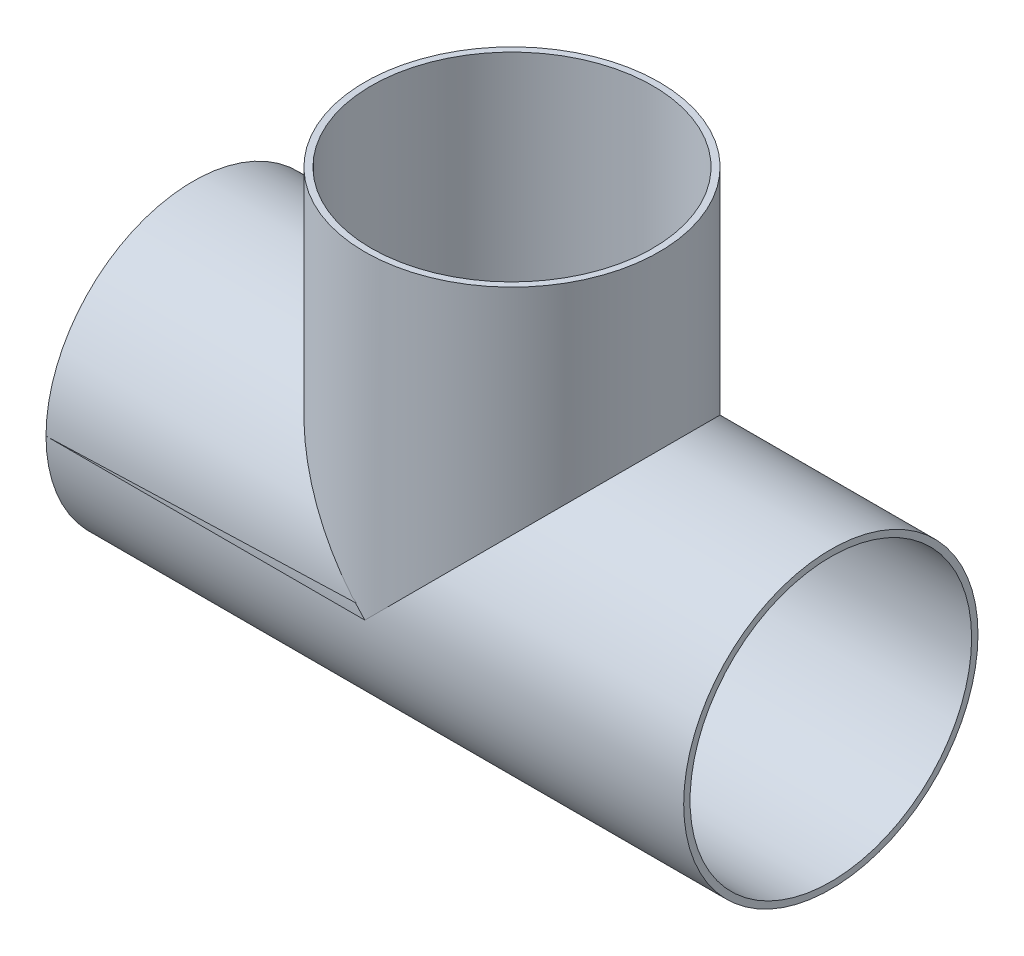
ISO-10303-21;
HEADER;
FILE_DESCRIPTION(('STEP AP214'),'2;1');
FILE_NAME('part.step','',(''),(''),'','','');
FILE_SCHEMA(('AUTOMOTIVE_DESIGN { 1 0 10303 214 1 1 1 1 }'));
ENDSEC;
DATA;
#1=APPLICATION_CONTEXT('core data for automotive mechanical design processes');
#2=APPLICATION_PROTOCOL_DEFINITION('international standard','automotive_design',2000,#1);
#3=PRODUCT_CONTEXT('',#1,'mechanical');
#4=PRODUCT('Part','Part','',(#3));
#5=PRODUCT_RELATED_PRODUCT_CATEGORY('part','',(#4));
#6=PRODUCT_DEFINITION_FORMATION('','',#4);
#7=PRODUCT_DEFINITION_CONTEXT('part definition',#1,'design');
#8=PRODUCT_DEFINITION('design','',#6,#7);
#9=PRODUCT_DEFINITION_SHAPE('','',#8);
#10=(LENGTH_UNIT() NAMED_UNIT(*) SI_UNIT(.MILLI.,.METRE.));
#11=(NAMED_UNIT(*) PLANE_ANGLE_UNIT() SI_UNIT($,.RADIAN.));
#12=(NAMED_UNIT(*) SI_UNIT($,.STERADIAN.) SOLID_ANGLE_UNIT());
#13=UNCERTAINTY_MEASURE_WITH_UNIT(LENGTH_MEASURE(1.E-05),#10,'distance_accuracy_value','');
#14=(GEOMETRIC_REPRESENTATION_CONTEXT(3) GLOBAL_UNCERTAINTY_ASSIGNED_CONTEXT((#13)) GLOBAL_UNIT_ASSIGNED_CONTEXT((#10,
#11,#12)) REPRESENTATION_CONTEXT('',''));
#15=CARTESIAN_POINT('',(0.,0.,0.));
#16=DIRECTION('',(0.,0.,1.));
#17=DIRECTION('',(1.,0.,0.));
#18=AXIS2_PLACEMENT_3D('',#15,#16,#17);
#19=CARTESIAN_POINT('',(0.,82.55,0.));
#20=DIRECTION('',(0.,-1.,0.));
#21=DIRECTION('',(0.,0.,-1.));
#22=AXIS2_PLACEMENT_3D('',#19,#20,#21);
#23=CYLINDRICAL_SURFACE('',#22,38.1);
#24=CARTESIAN_POINT('',(0.,82.55,0.));
#25=DIRECTION('',(0.,1.,0.));
#26=DIRECTION('',(0.,0.,1.));
#27=AXIS2_PLACEMENT_3D('',#24,#25,#26);
#28=CIRCLE('',#27,38.1);
#29=CARTESIAN_POINT('',(0.,82.55,38.1));
#30=VERTEX_POINT('',#29);
#31=EDGE_CURVE('E11',#30,#30,#28,.T.);
#32=ORIENTED_EDGE('',*,*,#31,.F.);
#33=EDGE_LOOP('',(#32));
#34=FACE_BOUND('',#33,.T.);
#35=CARTESIAN_POINT('',(0.,0.,0.));
#36=DIRECTION('',(-0.707106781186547,-0.707106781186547,0.));
#37=DIRECTION('',(0.707106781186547,-0.707106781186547,0.));
#38=AXIS2_PLACEMENT_3D('',#35,#36,#37);
#39=ELLIPSE('',#38,53.8815367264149,38.1);
#40=CARTESIAN_POINT('',(0.,0.,38.1));
#41=VERTEX_POINT('',#40);
#42=CARTESIAN_POINT('',(0.,0.,-38.1));
#43=VERTEX_POINT('',#42);
#44=EDGE_CURVE('E40',#41,#43,#39,.T.);
#45=ORIENTED_EDGE('',*,*,#44,.F.);
#46=CARTESIAN_POINT('',(0.,0.,0.));
#47=DIRECTION('',(0.707106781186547,-0.707106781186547,0.));
#48=DIRECTION('',(-0.707106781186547,-0.707106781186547,0.));
#49=AXIS2_PLACEMENT_3D('',#46,#47,#48);
#50=ELLIPSE('',#49,53.8815367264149,38.1);
#51=EDGE_CURVE('E53',#43,#41,#50,.T.);
#52=ORIENTED_EDGE('',*,*,#51,.F.);
#53=EDGE_LOOP('',(#45,#52));
#54=FACE_BOUND('',#53,.T.);
#55=ADVANCED_FACE('F33',(#34,#54),#23,.T.);
#56=CARTESIAN_POINT('',(0.,82.55,0.));
#57=DIRECTION('',(0.,1.,0.));
#58=DIRECTION('',(0.,0.,1.));
#59=AXIS2_PLACEMENT_3D('',#56,#57,#58);
#60=PLANE('',#59);
#61=CARTESIAN_POINT('',(0.,82.55,0.));
#62=DIRECTION('',(0.,1.,0.));
#63=DIRECTION('',(0.,0.,1.));
#64=AXIS2_PLACEMENT_3D('',#61,#62,#63);
#65=CIRCLE('',#64,36.449);
#66=CARTESIAN_POINT('',(0.,82.55,36.449));
#67=VERTEX_POINT('',#66);
#68=EDGE_CURVE('E65',#67,#67,#65,.T.);
#69=ORIENTED_EDGE('',*,*,#68,.F.);
#70=EDGE_LOOP('',(#69));
#71=FACE_BOUND('',#70,.T.);
#72=ORIENTED_EDGE('',*,*,#31,.T.);
#73=EDGE_LOOP('',(#72));
#74=FACE_BOUND('',#73,.T.);
#75=ADVANCED_FACE('F80',(#71,#74),#60,.T.);
#76=CARTESIAN_POINT('',(82.55,0.,0.));
#77=DIRECTION('',(-1.,0.,0.));
#78=DIRECTION('',(0.,0.,1.));
#79=AXIS2_PLACEMENT_3D('',#76,#77,#78);
#80=CYLINDRICAL_SURFACE('',#79,38.1);
#81=CARTESIAN_POINT('',(-82.55,0.,0.));
#82=DIRECTION('',(1.,0.,0.));
#83=DIRECTION('',(0.,0.,-1.));
#84=AXIS2_PLACEMENT_3D('',#81,#82,#83);
#85=CIRCLE('',#84,38.1);
#86=CARTESIAN_POINT('',(-82.55,0.,-38.1));
#87=VERTEX_POINT('',#86);
#88=EDGE_CURVE('E68',#87,#87,#85,.T.);
#89=ORIENTED_EDGE('',*,*,#88,.T.);
#90=EDGE_LOOP('',(#89));
#91=FACE_BOUND('',#90,.T.);
#92=CARTESIAN_POINT('',(82.55,0.,0.));
#93=DIRECTION('',(1.,0.,0.));
#94=DIRECTION('',(0.,0.,-1.));
#95=AXIS2_PLACEMENT_3D('',#92,#93,#94);
#96=CIRCLE('',#95,38.1);
#97=CARTESIAN_POINT('',(82.55,0.,-38.1));
#98=VERTEX_POINT('',#97);
#99=EDGE_CURVE('E72',#98,#98,#96,.T.);
#100=ORIENTED_EDGE('',*,*,#99,.F.);
#101=EDGE_LOOP('',(#100));
#102=FACE_BOUND('',#101,.T.);
#103=ORIENTED_EDGE('',*,*,#51,.T.);
#104=ORIENTED_EDGE('',*,*,#44,.T.);
#105=EDGE_LOOP('',(#103,#104));
#106=FACE_BOUND('',#105,.T.);
#107=ADVANCED_FACE('F78',(#91,#102,#106),#80,.T.);
#108=CARTESIAN_POINT('',(82.55,0.,0.));
#109=DIRECTION('',(1.,0.,0.));
#110=DIRECTION('',(0.,0.,-1.));
#111=AXIS2_PLACEMENT_3D('',#108,#109,#110);
#112=PLANE('',#111);
#113=CARTESIAN_POINT('',(82.55,0.,0.));
#114=DIRECTION('',(1.,0.,0.));
#115=DIRECTION('',(0.,0.,-1.));
#116=AXIS2_PLACEMENT_3D('',#113,#114,#115);
#117=CIRCLE('',#116,36.449);
#118=CARTESIAN_POINT('',(82.55,0.,-36.449));
#119=VERTEX_POINT('',#118);
#120=EDGE_CURVE('E112',#119,#119,#117,.T.);
#121=ORIENTED_EDGE('',*,*,#120,.F.);
#122=EDGE_LOOP('',(#121));
#123=FACE_BOUND('',#122,.T.);
#124=ORIENTED_EDGE('',*,*,#99,.T.);
#125=EDGE_LOOP('',(#124));
#126=FACE_BOUND('',#125,.T.);
#127=ADVANCED_FACE('F91',(#123,#126),#112,.T.);
#128=CARTESIAN_POINT('',(-82.55,0.,0.));
#129=DIRECTION('',(1.,0.,0.));
#130=DIRECTION('',(0.,0.,-1.));
#131=AXIS2_PLACEMENT_3D('',#128,#129,#130);
#132=PLANE('',#131);
#133=CARTESIAN_POINT('',(-82.55,0.,0.));
#134=DIRECTION('',(1.,0.,0.));
#135=DIRECTION('',(0.,0.,-1.));
#136=AXIS2_PLACEMENT_3D('',#133,#134,#135);
#137=CIRCLE('',#136,36.449);
#138=CARTESIAN_POINT('',(-82.55,0.,-36.449));
#139=VERTEX_POINT('',#138);
#140=EDGE_CURVE('E61',#139,#139,#137,.T.);
#141=ORIENTED_EDGE('',*,*,#140,.T.);
#142=EDGE_LOOP('',(#141));
#143=FACE_BOUND('',#142,.T.);
#144=ORIENTED_EDGE('',*,*,#88,.F.);
#145=EDGE_LOOP('',(#144));
#146=FACE_BOUND('',#145,.T.);
#147=ADVANCED_FACE('F96',(#143,#146),#132,.F.);
#148=CARTESIAN_POINT('',(0.,0.,0.));
#149=DIRECTION('',(0.,1.,0.));
#150=DIRECTION('',(0.,0.,1.));
#151=AXIS2_PLACEMENT_3D('',#148,#149,#150);
#152=CYLINDRICAL_SURFACE('',#151,36.449);
#153=CARTESIAN_POINT('',(0.,0.,0.));
#154=DIRECTION('',(-0.707106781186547,0.707106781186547,0.));
#155=DIRECTION('',(0.707106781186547,0.707106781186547,0.));
#156=AXIS2_PLACEMENT_3D('',#153,#154,#155);
#157=ELLIPSE('',#156,51.5466701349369,36.449);
#158=CARTESIAN_POINT('',(0.,0.,-36.449));
#159=VERTEX_POINT('',#158);
#160=CARTESIAN_POINT('',(0.,0.,36.449));
#161=VERTEX_POINT('',#160);
#162=EDGE_CURVE('E58',#159,#161,#157,.F.);
#163=ORIENTED_EDGE('',*,*,#162,.T.);
#164=CARTESIAN_POINT('',(0.,0.,0.));
#165=DIRECTION('',(0.707106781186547,0.707106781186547,0.));
#166=DIRECTION('',(-0.707106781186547,0.707106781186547,0.));
#167=AXIS2_PLACEMENT_3D('',#164,#165,#166);
#168=ELLIPSE('',#167,51.5466701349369,36.449);
#169=EDGE_CURVE('E46',#161,#159,#168,.F.);
#170=ORIENTED_EDGE('',*,*,#169,.T.);
#171=EDGE_LOOP('',(#163,#170));
#172=FACE_BOUND('',#171,.T.);
#173=ORIENTED_EDGE('',*,*,#68,.T.);
#174=EDGE_LOOP('',(#173));
#175=FACE_BOUND('',#174,.T.);
#176=ADVANCED_FACE('F63',(#172,#175),#152,.F.);
#177=CARTESIAN_POINT('',(-82.55,0.,0.));
#178=DIRECTION('',(1.,0.,0.));
#179=DIRECTION('',(0.,0.,-1.));
#180=AXIS2_PLACEMENT_3D('',#177,#178,#179);
#181=CYLINDRICAL_SURFACE('',#180,36.449);
#182=ORIENTED_EDGE('',*,*,#120,.T.);
#183=EDGE_LOOP('',(#182));
#184=FACE_BOUND('',#183,.T.);
#185=ORIENTED_EDGE('',*,*,#140,.F.);
#186=EDGE_LOOP('',(#185));
#187=FACE_BOUND('',#186,.T.);
#188=ORIENTED_EDGE('',*,*,#162,.F.);
#189=ORIENTED_EDGE('',*,*,#169,.F.);
#190=EDGE_LOOP('',(#188,#189));
#191=FACE_BOUND('',#190,.T.);
#192=ADVANCED_FACE('F59',(#184,#187,#191),#181,.F.);
#193=CLOSED_SHELL('',(#55,#75,#107,#127,#147,#176,#192));
#194=MANIFOLD_SOLID_BREP('B2',#193);
#195=ADVANCED_BREP_SHAPE_REPRESENTATION('',(#18,#194),#14);
#196=SHAPE_DEFINITION_REPRESENTATION(#9,#195);
ENDSEC;
END-ISO-10303-21;
